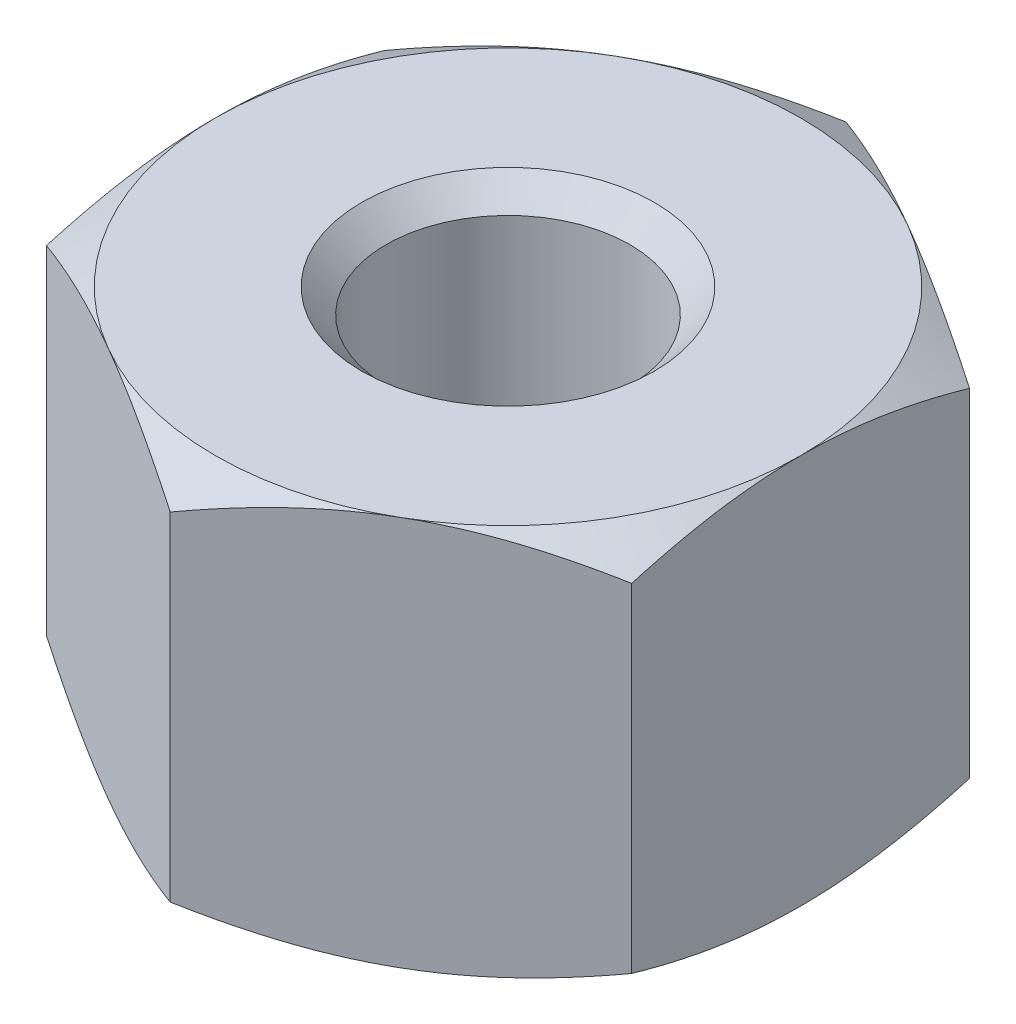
ISO-10303-21;
HEADER;
FILE_DESCRIPTION(('STEP AP214'),'2;1');
FILE_NAME('part.step','',(''),(''),'','','');
FILE_SCHEMA(('AUTOMOTIVE_DESIGN { 1 0 10303 214 1 1 1 1 }'));
ENDSEC;
DATA;
#1=APPLICATION_CONTEXT('core data for automotive mechanical design processes');
#2=APPLICATION_PROTOCOL_DEFINITION('international standard','automotive_design',2000,#1);
#3=PRODUCT_CONTEXT('',#1,'mechanical');
#4=PRODUCT('Part','Part','',(#3));
#5=PRODUCT_RELATED_PRODUCT_CATEGORY('part','',(#4));
#6=PRODUCT_DEFINITION_FORMATION('','',#4);
#7=PRODUCT_DEFINITION_CONTEXT('part definition',#1,'design');
#8=PRODUCT_DEFINITION('design','',#6,#7);
#9=PRODUCT_DEFINITION_SHAPE('','',#8);
#10=(LENGTH_UNIT() NAMED_UNIT(*) SI_UNIT(.MILLI.,.METRE.));
#11=(NAMED_UNIT(*) PLANE_ANGLE_UNIT() SI_UNIT($,.RADIAN.));
#12=(NAMED_UNIT(*) SI_UNIT($,.STERADIAN.) SOLID_ANGLE_UNIT());
#13=UNCERTAINTY_MEASURE_WITH_UNIT(LENGTH_MEASURE(1.E-05),#10,'distance_accuracy_value','');
#14=(GEOMETRIC_REPRESENTATION_CONTEXT(3) GLOBAL_UNCERTAINTY_ASSIGNED_CONTEXT((#13)) GLOBAL_UNIT_ASSIGNED_CONTEXT((#10,
#11,#12)) REPRESENTATION_CONTEXT('',''));
#15=CARTESIAN_POINT('',(0.,0.,0.));
#16=DIRECTION('',(0.,0.,1.));
#17=DIRECTION('',(1.,0.,0.));
#18=AXIS2_PLACEMENT_3D('',#15,#16,#17);
#19=CARTESIAN_POINT('',(0.,-2.,0.));
#20=DIRECTION('',(0.,1.,0.));
#21=DIRECTION('',(0.,0.,1.));
#22=AXIS2_PLACEMENT_3D('',#19,#20,#21);
#23=PLANE('',#22);
#24=CARTESIAN_POINT('',(0.,-2.,0.));
#25=DIRECTION('',(0.,1.,0.));
#26=DIRECTION('',(0.,0.,1.));
#27=AXIS2_PLACEMENT_3D('',#24,#25,#26);
#28=CIRCLE('',#27,1.5);
#29=CARTESIAN_POINT('',(0.,-2.,1.5));
#30=VERTEX_POINT('',#29);
#31=EDGE_CURVE('E12',#30,#30,#28,.T.);
#32=ORIENTED_EDGE('',*,*,#31,.T.);
#33=EDGE_LOOP('',(#32));
#34=FACE_BOUND('',#33,.T.);
#35=CARTESIAN_POINT('',(0.,-2.,0.));
#36=DIRECTION('',(0.,1.,0.));
#37=DIRECTION('',(0.,0.,1.));
#38=AXIS2_PLACEMENT_3D('',#35,#36,#37);
#39=CIRCLE('',#38,3.);
#40=CARTESIAN_POINT('',(1.5,-2.,2.59807621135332));
#41=VERTEX_POINT('',#40);
#42=CARTESIAN_POINT('',(-1.5,-2.,2.59807621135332));
#43=VERTEX_POINT('',#42);
#44=EDGE_CURVE('E140',#41,#43,#39,.F.);
#45=ORIENTED_EDGE('',*,*,#44,.T.);
#46=CARTESIAN_POINT('',(-3.,-2.,0.));
#47=VERTEX_POINT('',#46);
#48=EDGE_CURVE('E53',#43,#47,#39,.F.);
#49=ORIENTED_EDGE('',*,*,#48,.T.);
#50=CARTESIAN_POINT('',(-1.5,-2.,-2.59807621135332));
#51=VERTEX_POINT('',#50);
#52=EDGE_CURVE('E379',#47,#51,#39,.F.);
#53=ORIENTED_EDGE('',*,*,#52,.T.);
#54=CARTESIAN_POINT('',(1.5,-2.,-2.59807621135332));
#55=VERTEX_POINT('',#54);
#56=EDGE_CURVE('E381',#51,#55,#39,.F.);
#57=ORIENTED_EDGE('',*,*,#56,.T.);
#58=CARTESIAN_POINT('',(3.,-2.,0.));
#59=VERTEX_POINT('',#58);
#60=EDGE_CURVE('E145',#55,#59,#39,.F.);
#61=ORIENTED_EDGE('',*,*,#60,.T.);
#62=CARTESIAN_POINT('',(0.,-2.,0.));
#63=DIRECTION('',(0.,1.,0.));
#64=DIRECTION('',(0.,0.,1.));
#65=AXIS2_PLACEMENT_3D('',#62,#63,#64);
#66=CIRCLE('',#65,3.);
#67=EDGE_CURVE('E131',#41,#59,#66,.T.);
#68=ORIENTED_EDGE('',*,*,#67,.F.);
#69=EDGE_LOOP('',(#45,#49,#53,#57,#61,#68));
#70=FACE_BOUND('',#69,.T.);
#71=ADVANCED_FACE('F38',(#34,#70),#23,.F.);
#72=CARTESIAN_POINT('',(0.,2.,3.46410161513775));
#73=DIRECTION('',(-0.5,0.,-0.866025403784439));
#74=DIRECTION('',(-0.866025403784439,0.,0.5));
#75=AXIS2_PLACEMENT_3D('',#72,#73,#74);
#76=PLANE('',#75);
#77=DIRECTION('',(0.,-1.,0.));
#78=VECTOR('',#77,1.);
#79=CARTESIAN_POINT('',(0.,2.,3.46410161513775));
#80=LINE('',#79,#78);
#81=CARTESIAN_POINT('',(0.,1.73205080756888,3.46410161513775));
#82=VERTEX_POINT('',#81);
#83=CARTESIAN_POINT('',(0.,-1.73205080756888,3.46410161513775));
#84=VERTEX_POINT('',#83);
#85=EDGE_CURVE('E155',#82,#84,#80,.T.);
#86=ORIENTED_EDGE('',*,*,#85,.T.);
#87=CARTESIAN_POINT('',(-0.000200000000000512,-1.73198413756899,3.46421708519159));
#88=CARTESIAN_POINT('',(0.131635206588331,-1.77594629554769,3.38810199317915));
#89=CARTESIAN_POINT('',(0.264608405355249,-1.81592841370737,3.31132988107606));
#90=CARTESIAN_POINT('',(0.532857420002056,-1.88571791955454,3.15645624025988));
#91=CARTESIAN_POINT('',(0.668138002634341,-1.91550061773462,3.078351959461));
#92=CARTESIAN_POINT('',(0.937022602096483,-1.96186216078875,2.92311136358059));
#93=CARTESIAN_POINT('',(1.07058524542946,-1.97874955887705,2.84599893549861));
#94=CARTESIAN_POINT('',(1.33833905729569,-1.99891035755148,2.6914112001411));
#95=CARTESIAN_POINT('',(1.47252925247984,-2.00220045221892,2.61393645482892));
#96=CARTESIAN_POINT('',(1.72327559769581,-1.99535946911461,2.46916798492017));
#97=CARTESIAN_POINT('',(1.83986926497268,-1.98690808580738,2.40185259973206));
#98=CARTESIAN_POINT('',(2.07229698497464,-1.96012105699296,2.2676603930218));
#99=CARTESIAN_POINT('',(2.18813023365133,-1.94177625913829,2.2007840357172));
#100=CARTESIAN_POINT('',(2.42103725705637,-1.89591524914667,2.06631510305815));
#101=CARTESIAN_POINT('',(2.53808155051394,-1.86820461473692,1.99873954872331));
#102=CARTESIAN_POINT('',(2.77042435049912,-1.8053122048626,1.86459637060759));
#103=CARTESIAN_POINT('',(2.88572583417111,-1.77014520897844,1.79802702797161));
#104=CARTESIAN_POINT('',(3.0002,-1.73198413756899,1.73193533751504));
#105=B_SPLINE_CURVE_WITH_KNOTS('',3,(#87,#88,#89,#90,#91,#92,#93,#94,#95,#96,#97,#98,#99,#100,
#101,#102,#103,#104),.UNSPECIFIED.,.F.,.F.,(4,2,2,2,2,2,2,2,4),(0.,0.475539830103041,
0.952222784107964,1.41710776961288,1.88142182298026,2.28572436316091,2.69040156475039,
3.10405572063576,3.5168974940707),.UNSPECIFIED.);
#106=EDGE_CURVE('E60',#84,#41,#105,.T.);
#107=ORIENTED_EDGE('',*,*,#106,.T.);
#108=CARTESIAN_POINT('',(3.,-1.73205080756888,1.73205080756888));
#109=VERTEX_POINT('',#108);
#110=EDGE_CURVE('E128',#41,#109,#105,.T.);
#111=ORIENTED_EDGE('',*,*,#110,.T.);
#112=DIRECTION('',(0.,-1.,0.));
#113=VECTOR('',#112,1.);
#114=CARTESIAN_POINT('',(3.,2.,1.73205080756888));
#115=LINE('',#114,#113);
#116=CARTESIAN_POINT('',(3.,1.73205080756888,1.73205080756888));
#117=VERTEX_POINT('',#116);
#118=EDGE_CURVE('E272',#117,#109,#115,.T.);
#119=ORIENTED_EDGE('',*,*,#118,.F.);
#120=CARTESIAN_POINT('',(-0.000200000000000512,1.73198413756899,3.46421708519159));
#121=CARTESIAN_POINT('',(0.131635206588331,1.77594629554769,3.38810199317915));
#122=CARTESIAN_POINT('',(0.264608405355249,1.81592841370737,3.31132988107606));
#123=CARTESIAN_POINT('',(0.532857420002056,1.88571791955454,3.15645624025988));
#124=CARTESIAN_POINT('',(0.668138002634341,1.91550061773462,3.078351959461));
#125=CARTESIAN_POINT('',(0.937022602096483,1.96186216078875,2.92311136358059));
#126=CARTESIAN_POINT('',(1.07058524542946,1.97874955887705,2.84599893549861));
#127=CARTESIAN_POINT('',(1.33833905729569,1.99891035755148,2.6914112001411));
#128=CARTESIAN_POINT('',(1.47252925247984,2.00220045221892,2.61393645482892));
#129=CARTESIAN_POINT('',(1.72327559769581,1.99535946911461,2.46916798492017));
#130=CARTESIAN_POINT('',(1.83986926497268,1.98690808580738,2.40185259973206));
#131=CARTESIAN_POINT('',(2.07229698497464,1.96012105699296,2.2676603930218));
#132=CARTESIAN_POINT('',(2.18813023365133,1.94177625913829,2.2007840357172));
#133=CARTESIAN_POINT('',(2.42103725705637,1.89591524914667,2.06631510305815));
#134=CARTESIAN_POINT('',(2.53808155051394,1.86820461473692,1.99873954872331));
#135=CARTESIAN_POINT('',(2.77042435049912,1.8053122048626,1.86459637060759));
#136=CARTESIAN_POINT('',(2.88572583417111,1.77014520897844,1.79802702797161));
#137=CARTESIAN_POINT('',(3.0002,1.73198413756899,1.73193533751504));
#138=B_SPLINE_CURVE_WITH_KNOTS('',3,(#120,#121,#122,#123,#124,#125,#126,#127,#128,#129,#130,
#131,#132,#133,#134,#135,#136,#137),.UNSPECIFIED.,.F.,.F.,(4,2,2,2,2,2,2,2,4),(0.,
0.475539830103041,0.952222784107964,1.41710776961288,1.88142182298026,2.28572436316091,
2.69040156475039,3.10405572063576,3.5168974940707),.UNSPECIFIED.);
#139=CARTESIAN_POINT('',(1.5,2.,2.59807621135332));
#140=VERTEX_POINT('',#139);
#141=EDGE_CURVE('E252',#140,#117,#138,.T.);
#142=ORIENTED_EDGE('',*,*,#141,.F.);
#143=EDGE_CURVE('E258',#82,#140,#138,.T.);
#144=ORIENTED_EDGE('',*,*,#143,.F.);
#145=EDGE_LOOP('',(#86,#107,#111,#119,#142,#144));
#146=FACE_BOUND('',#145,.T.);
#147=ADVANCED_FACE('F152',(#146),#76,.F.);
#148=CARTESIAN_POINT('',(3.,2.,1.73205080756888));
#149=DIRECTION('',(-1.,0.,0.));
#150=DIRECTION('',(0.,0.,1.));
#151=AXIS2_PLACEMENT_3D('',#148,#149,#150);
#152=PLANE('',#151);
#153=ORIENTED_EDGE('',*,*,#118,.T.);
#154=CARTESIAN_POINT('',(3.,-0.501054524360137,-4.72419421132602));
#155=CARTESIAN_POINT('',(3.,-0.565208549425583,-4.59252982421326));
#156=CARTESIAN_POINT('',(3.,-0.628767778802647,-4.46057075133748));
#157=CARTESIAN_POINT('',(3.,-0.75436344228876,-4.19590675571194));
#158=CARTESIAN_POINT('',(3.,-0.816399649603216,-4.06320172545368));
#159=CARTESIAN_POINT('',(3.,-0.938912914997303,-3.79623955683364));
#160=CARTESIAN_POINT('',(3.,-0.999380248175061,-3.66197794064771));
#161=CARTESIAN_POINT('',(3.,-1.11793387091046,-3.39241144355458));
#162=CARTESIAN_POINT('',(3.,-1.17602026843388,-3.25710661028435));
#163=CARTESIAN_POINT('',(3.,-1.29110063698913,-2.98063811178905));
#164=CARTESIAN_POINT('',(3.,-1.34799110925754,-2.83943113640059));
#165=CARTESIAN_POINT('',(3.,-1.45763737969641,-2.55539190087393));
#166=CARTESIAN_POINT('',(3.,-1.51039272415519,-2.41255946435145));
#167=CARTESIAN_POINT('',(3.,-1.61043634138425,-2.12528687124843));
#168=CARTESIAN_POINT('',(3.,-1.65773508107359,-1.98085039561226));
#169=CARTESIAN_POINT('',(3.,-1.74539546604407,-1.68990675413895));
#170=CARTESIAN_POINT('',(3.,-1.78575922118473,-1.54340023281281));
#171=CARTESIAN_POINT('',(3.,-1.8574462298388,-1.2490437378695));
#172=CARTESIAN_POINT('',(3.,-1.88882005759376,-1.10120630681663));
#173=CARTESIAN_POINT('',(3.,-1.94080019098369,-0.803620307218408));
#174=CARTESIAN_POINT('',(3.,-1.96140766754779,-0.653871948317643));
#175=CARTESIAN_POINT('',(3.,-1.98994502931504,-0.355196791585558));
#176=CARTESIAN_POINT('',(3.,-1.99804348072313,-0.206286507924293));
#177=CARTESIAN_POINT('',(3.,-2.0013247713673,0.0916923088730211));
#178=CARTESIAN_POINT('',(3.,-1.9965074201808,0.240760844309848));
#179=CARTESIAN_POINT('',(3.,-1.97787199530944,0.491723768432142));
#180=CARTESIAN_POINT('',(3.,-1.96731758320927,0.593876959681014));
#181=CARTESIAN_POINT('',(3.,-1.94076249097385,0.797477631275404));
#182=CARTESIAN_POINT('',(3.,-1.92476113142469,0.898925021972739));
#183=CARTESIAN_POINT('',(3.,-1.86942337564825,1.20204703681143));
#184=CARTESIAN_POINT('',(3.,-1.82276174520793,1.40240158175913));
#185=CARTESIAN_POINT('',(3.,-1.74129864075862,1.70214891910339));
#186=CARTESIAN_POINT('',(3.,-1.71182816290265,1.80307937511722));
#187=CARTESIAN_POINT('',(3.,-1.64969066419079,2.00396102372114));
#188=CARTESIAN_POINT('',(3.,-1.61702361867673,2.10391220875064));
#189=CARTESIAN_POINT('',(3.,-1.54902842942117,2.30286555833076));
#190=CARTESIAN_POINT('',(3.,-1.51370103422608,2.40186798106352));
#191=CARTESIAN_POINT('',(3.,-1.44081429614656,2.59904247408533));
#192=CARTESIAN_POINT('',(3.,-1.40325500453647,2.69721456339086));
#193=CARTESIAN_POINT('',(3.,-1.29921162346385,2.96159002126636));
#194=CARTESIAN_POINT('',(3.,-1.23095748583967,3.12709614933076));
#195=CARTESIAN_POINT('',(3.,-1.09043300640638,3.45640087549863));
#196=CARTESIAN_POINT('',(3.,-1.01816221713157,3.62019928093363));
#197=CARTESIAN_POINT('',(3.,-0.870559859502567,3.94647574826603));
#198=CARTESIAN_POINT('',(3.,-0.795227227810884,4.10895332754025));
#199=CARTESIAN_POINT('',(3.,-0.642221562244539,4.43280485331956));
#200=CARTESIAN_POINT('',(3.,-0.564548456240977,4.59417876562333));
#201=CARTESIAN_POINT('',(3.,-0.328572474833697,5.07748126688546));
#202=CARTESIAN_POINT('',(3.,-0.167548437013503,5.39807947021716));
#203=CARTESIAN_POINT('',(3.,0.159040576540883,6.03685099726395));
#204=CARTESIAN_POINT('',(3.,0.324604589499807,6.35502481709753));
#205=CARTESIAN_POINT('',(3.,0.641121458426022,6.95610524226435));
#206=CARTESIAN_POINT('',(3.,0.791763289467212,7.23917590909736));
#207=CARTESIAN_POINT('',(3.,1.09485975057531,7.80436605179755));
#208=CARTESIAN_POINT('',(3.,1.24731449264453,8.08648546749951));
#209=CARTESIAN_POINT('',(3.,1.55305256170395,8.6490441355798));
#210=CARTESIAN_POINT('',(3.,1.70633136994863,8.92948584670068));
#211=CARTESIAN_POINT('',(3.,2.01391884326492,9.4897751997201));
#212=CARTESIAN_POINT('',(3.,2.16822742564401,9.76962288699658));
#213=CARTESIAN_POINT('',(3.,2.32291043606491,10.0492620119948));
#214=B_SPLINE_CURVE_WITH_KNOTS('',3,(#154,#155,#156,#157,#158,#159,#160,#161,#162,#163,#164,
#165,#166,#167,#168,#169,#170,#171,#172,#173,#174,#175,#176,#177,#178,#179,#180,#181,#182,#183,
#184,#185,#186,#187,#188,#189,#190,#191,#192,#193,#194,#195,#196,#197,#198,#199,#200,#201,#202,
#203,#204,#205,#206,#207,#208,#209,#210,#211,#212,#213),.UNSPECIFIED.,.F.,.F.,(4,2,2,2,2,2,2,2,
2,2,2,2,2,2,2,2,2,2,2,2,2,2,2,2,2,2,2,2,2,4),(0.,0.439392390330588,0.878849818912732,
1.32058042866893,1.76229098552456,2.21895022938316,2.67565950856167,3.13147762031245,
3.58715681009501,4.04021978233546,4.49323346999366,4.94008757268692,5.38694826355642,
5.69489123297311,6.00287262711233,6.61913487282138,6.934541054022,7.24994966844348,
7.56526986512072,7.88058282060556,8.41758645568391,8.95465003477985,9.49190174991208,
10.0291700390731,11.1053945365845,12.1813925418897,13.1433594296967,14.1053860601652,
15.0641732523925,16.0228843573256),.UNSPECIFIED.);
#215=EDGE_CURVE('E134',#109,#59,#214,.F.);
#216=ORIENTED_EDGE('',*,*,#215,.T.);
#217=CARTESIAN_POINT('',(3.,-1.73205080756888,-1.73205080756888));
#218=VERTEX_POINT('',#217);
#219=EDGE_CURVE('E167',#59,#218,#214,.F.);
#220=ORIENTED_EDGE('',*,*,#219,.T.);
#221=DIRECTION('',(0.,-1.,0.));
#222=VECTOR('',#221,1.);
#223=CARTESIAN_POINT('',(3.,2.,-1.73205080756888));
#224=LINE('',#223,#222);
#225=CARTESIAN_POINT('',(3.,1.73205080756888,-1.73205080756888));
#226=VERTEX_POINT('',#225);
#227=EDGE_CURVE('E269',#226,#218,#224,.T.);
#228=ORIENTED_EDGE('',*,*,#227,.F.);
#229=CARTESIAN_POINT('',(3.,0.501054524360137,-4.72419421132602));
#230=CARTESIAN_POINT('',(3.,0.565208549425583,-4.59252982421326));
#231=CARTESIAN_POINT('',(3.,0.628767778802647,-4.46057075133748));
#232=CARTESIAN_POINT('',(3.,0.75436344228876,-4.19590675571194));
#233=CARTESIAN_POINT('',(3.,0.816399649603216,-4.06320172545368));
#234=CARTESIAN_POINT('',(3.,0.938912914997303,-3.79623955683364));
#235=CARTESIAN_POINT('',(3.,0.999380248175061,-3.66197794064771));
#236=CARTESIAN_POINT('',(3.,1.11793387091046,-3.39241144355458));
#237=CARTESIAN_POINT('',(3.,1.17602026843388,-3.25710661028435));
#238=CARTESIAN_POINT('',(3.,1.29110063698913,-2.98063811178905));
#239=CARTESIAN_POINT('',(3.,1.34799110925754,-2.83943113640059));
#240=CARTESIAN_POINT('',(3.,1.45763737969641,-2.55539190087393));
#241=CARTESIAN_POINT('',(3.,1.51039272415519,-2.41255946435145));
#242=CARTESIAN_POINT('',(3.,1.61043634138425,-2.12528687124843));
#243=CARTESIAN_POINT('',(3.,1.65773508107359,-1.98085039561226));
#244=CARTESIAN_POINT('',(3.,1.74539546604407,-1.68990675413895));
#245=CARTESIAN_POINT('',(3.,1.78575922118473,-1.54340023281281));
#246=CARTESIAN_POINT('',(3.,1.8574462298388,-1.2490437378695));
#247=CARTESIAN_POINT('',(3.,1.88882005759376,-1.10120630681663));
#248=CARTESIAN_POINT('',(3.,1.94080019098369,-0.803620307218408));
#249=CARTESIAN_POINT('',(3.,1.96140766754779,-0.653871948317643));
#250=CARTESIAN_POINT('',(3.,1.98994502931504,-0.355196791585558));
#251=CARTESIAN_POINT('',(3.,1.99804348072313,-0.206286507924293));
#252=CARTESIAN_POINT('',(3.,2.0013247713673,0.0916923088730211));
#253=CARTESIAN_POINT('',(3.,1.9965074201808,0.240760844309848));
#254=CARTESIAN_POINT('',(3.,1.97787199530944,0.491723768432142));
#255=CARTESIAN_POINT('',(3.,1.96731758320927,0.593876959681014));
#256=CARTESIAN_POINT('',(3.,1.94076249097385,0.797477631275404));
#257=CARTESIAN_POINT('',(3.,1.92476113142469,0.898925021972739));
#258=CARTESIAN_POINT('',(3.,1.86942337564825,1.20204703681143));
#259=CARTESIAN_POINT('',(3.,1.82276174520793,1.40240158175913));
#260=CARTESIAN_POINT('',(3.,1.74129864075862,1.70214891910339));
#261=CARTESIAN_POINT('',(3.,1.71182816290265,1.80307937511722));
#262=CARTESIAN_POINT('',(3.,1.64969066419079,2.00396102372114));
#263=CARTESIAN_POINT('',(3.,1.61702361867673,2.10391220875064));
#264=CARTESIAN_POINT('',(3.,1.54902842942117,2.30286555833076));
#265=CARTESIAN_POINT('',(3.,1.51370103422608,2.40186798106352));
#266=CARTESIAN_POINT('',(3.,1.44081429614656,2.59904247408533));
#267=CARTESIAN_POINT('',(3.,1.40325500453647,2.69721456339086));
#268=CARTESIAN_POINT('',(3.,1.29921162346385,2.96159002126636));
#269=CARTESIAN_POINT('',(3.,1.23095748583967,3.12709614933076));
#270=CARTESIAN_POINT('',(3.,1.09043300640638,3.45640087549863));
#271=CARTESIAN_POINT('',(3.,1.01816221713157,3.62019928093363));
#272=CARTESIAN_POINT('',(3.,0.870559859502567,3.94647574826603));
#273=CARTESIAN_POINT('',(3.,0.795227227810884,4.10895332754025));
#274=CARTESIAN_POINT('',(3.,0.642221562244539,4.43280485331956));
#275=CARTESIAN_POINT('',(3.,0.564548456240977,4.59417876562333));
#276=CARTESIAN_POINT('',(3.,0.328572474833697,5.07748126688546));
#277=CARTESIAN_POINT('',(3.,0.167548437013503,5.39807947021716));
#278=CARTESIAN_POINT('',(3.,-0.159040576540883,6.03685099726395));
#279=CARTESIAN_POINT('',(3.,-0.324604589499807,6.35502481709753));
#280=CARTESIAN_POINT('',(3.,-0.641121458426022,6.95610524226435));
#281=CARTESIAN_POINT('',(3.,-0.791763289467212,7.23917590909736));
#282=CARTESIAN_POINT('',(3.,-1.09485975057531,7.80436605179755));
#283=CARTESIAN_POINT('',(3.,-1.24731449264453,8.08648546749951));
#284=CARTESIAN_POINT('',(3.,-1.55305256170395,8.6490441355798));
#285=CARTESIAN_POINT('',(3.,-1.70633136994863,8.92948584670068));
#286=CARTESIAN_POINT('',(3.,-2.01391884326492,9.4897751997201));
#287=CARTESIAN_POINT('',(3.,-2.16822742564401,9.76962288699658));
#288=CARTESIAN_POINT('',(3.,-2.32291043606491,10.0492620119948));
#289=B_SPLINE_CURVE_WITH_KNOTS('',3,(#229,#230,#231,#232,#233,#234,#235,#236,#237,#238,#239,
#240,#241,#242,#243,#244,#245,#246,#247,#248,#249,#250,#251,#252,#253,#254,#255,#256,#257,#258,
#259,#260,#261,#262,#263,#264,#265,#266,#267,#268,#269,#270,#271,#272,#273,#274,#275,#276,#277,
#278,#279,#280,#281,#282,#283,#284,#285,#286,#287,#288),.UNSPECIFIED.,.F.,.F.,(4,2,2,2,2,2,2,2,
2,2,2,2,2,2,2,2,2,2,2,2,2,2,2,2,2,2,2,2,2,4),(0.,0.439392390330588,0.878849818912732,
1.32058042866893,1.76229098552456,2.21895022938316,2.67565950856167,3.13147762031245,
3.58715681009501,4.04021978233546,4.49323346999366,4.94008757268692,5.38694826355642,
5.69489123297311,6.00287262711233,6.61913487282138,6.934541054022,7.24994966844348,
7.56526986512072,7.88058282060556,8.41758645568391,8.95465003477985,9.49190174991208,
10.0291700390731,11.1053945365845,12.1813925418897,13.1433594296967,14.1053860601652,
15.0641732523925,16.0228843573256),.UNSPECIFIED.);
#290=CARTESIAN_POINT('',(3.,2.,0.));
#291=VERTEX_POINT('',#290);
#292=EDGE_CURVE('E245',#291,#226,#289,.F.);
#293=ORIENTED_EDGE('',*,*,#292,.F.);
#294=EDGE_CURVE('E251',#117,#291,#289,.F.);
#295=ORIENTED_EDGE('',*,*,#294,.F.);
#296=EDGE_LOOP('',(#153,#216,#220,#228,#293,#295));
#297=FACE_BOUND('',#296,.T.);
#298=ADVANCED_FACE('F224',(#297),#152,.F.);
#299=CARTESIAN_POINT('',(3.,2.,-1.73205080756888));
#300=DIRECTION('',(-0.5,0.,0.866025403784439));
#301=DIRECTION('',(0.866025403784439,0.,0.5));
#302=AXIS2_PLACEMENT_3D('',#299,#300,#301);
#303=PLANE('',#302);
#304=ORIENTED_EDGE('',*,*,#227,.T.);
#305=CARTESIAN_POINT('',(3.0002,-1.73198413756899,-1.73193533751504));
#306=CARTESIAN_POINT('',(2.86836479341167,-1.77594629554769,-1.80805042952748));
#307=CARTESIAN_POINT('',(2.73539159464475,-1.81592841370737,-1.88482254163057));
#308=CARTESIAN_POINT('',(2.46714257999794,-1.88571791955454,-2.03969618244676));
#309=CARTESIAN_POINT('',(2.33186199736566,-1.91550061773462,-2.11780046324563));
#310=CARTESIAN_POINT('',(2.06297739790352,-1.96186216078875,-2.27304105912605));
#311=CARTESIAN_POINT('',(1.92941475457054,-1.97874955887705,-2.35015348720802));
#312=CARTESIAN_POINT('',(1.66166094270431,-1.99891035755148,-2.50474122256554));
#313=CARTESIAN_POINT('',(1.52747074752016,-2.00220045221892,-2.58221596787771));
#314=CARTESIAN_POINT('',(1.27672440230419,-1.99535946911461,-2.72698443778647));
#315=CARTESIAN_POINT('',(1.16013073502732,-1.98690808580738,-2.79429982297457));
#316=CARTESIAN_POINT('',(0.927703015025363,-1.96012105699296,-2.92849202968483));
#317=CARTESIAN_POINT('',(0.811869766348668,-1.94177625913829,-2.99536838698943));
#318=CARTESIAN_POINT('',(0.578962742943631,-1.89591524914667,-3.12983731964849));
#319=CARTESIAN_POINT('',(0.461918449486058,-1.86820461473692,-3.19741287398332));
#320=CARTESIAN_POINT('',(0.229575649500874,-1.8053122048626,-3.33155605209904));
#321=CARTESIAN_POINT('',(0.114274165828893,-1.77014520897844,-3.39812539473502));
#322=CARTESIAN_POINT('',(-0.000200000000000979,-1.73198413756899,-3.46421708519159));
#323=B_SPLINE_CURVE_WITH_KNOTS('',3,(#305,#306,#307,#308,#309,#310,#311,#312,#313,#314,#315,
#316,#317,#318,#319,#320,#321,#322),.UNSPECIFIED.,.F.,.F.,(4,2,2,2,2,2,2,2,4),(0.,
0.475539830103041,0.952222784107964,1.41710776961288,1.88142182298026,2.28572436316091,
2.69040156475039,3.10405572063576,3.5168974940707),.UNSPECIFIED.);
#324=EDGE_CURVE('E218',#218,#55,#323,.T.);
#325=ORIENTED_EDGE('',*,*,#324,.T.);
#326=CARTESIAN_POINT('',(0.,-1.73205080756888,-3.46410161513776));
#327=VERTEX_POINT('',#326);
#328=EDGE_CURVE('E211',#55,#327,#323,.T.);
#329=ORIENTED_EDGE('',*,*,#328,.T.);
#330=DIRECTION('',(0.,-1.,0.));
#331=VECTOR('',#330,1.);
#332=CARTESIAN_POINT('',(0.,2.,-3.46410161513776));
#333=LINE('',#332,#331);
#334=CARTESIAN_POINT('',(0.,1.73205080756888,-3.46410161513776));
#335=VERTEX_POINT('',#334);
#336=EDGE_CURVE('E266',#335,#327,#333,.T.);
#337=ORIENTED_EDGE('',*,*,#336,.F.);
#338=CARTESIAN_POINT('',(3.0002,1.73198413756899,-1.73193533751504));
#339=CARTESIAN_POINT('',(2.86836479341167,1.77594629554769,-1.80805042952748));
#340=CARTESIAN_POINT('',(2.73539159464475,1.81592841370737,-1.88482254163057));
#341=CARTESIAN_POINT('',(2.46714257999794,1.88571791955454,-2.03969618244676));
#342=CARTESIAN_POINT('',(2.33186199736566,1.91550061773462,-2.11780046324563));
#343=CARTESIAN_POINT('',(2.06297739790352,1.96186216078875,-2.27304105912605));
#344=CARTESIAN_POINT('',(1.92941475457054,1.97874955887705,-2.35015348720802));
#345=CARTESIAN_POINT('',(1.66166094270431,1.99891035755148,-2.50474122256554));
#346=CARTESIAN_POINT('',(1.52747074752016,2.00220045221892,-2.58221596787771));
#347=CARTESIAN_POINT('',(1.27672440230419,1.99535946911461,-2.72698443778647));
#348=CARTESIAN_POINT('',(1.16013073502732,1.98690808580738,-2.79429982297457));
#349=CARTESIAN_POINT('',(0.927703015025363,1.96012105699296,-2.92849202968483));
#350=CARTESIAN_POINT('',(0.811869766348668,1.94177625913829,-2.99536838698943));
#351=CARTESIAN_POINT('',(0.578962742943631,1.89591524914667,-3.12983731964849));
#352=CARTESIAN_POINT('',(0.461918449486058,1.86820461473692,-3.19741287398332));
#353=CARTESIAN_POINT('',(0.229575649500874,1.8053122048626,-3.33155605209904));
#354=CARTESIAN_POINT('',(0.114274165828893,1.77014520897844,-3.39812539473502));
#355=CARTESIAN_POINT('',(-0.000200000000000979,1.73198413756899,-3.46421708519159));
#356=B_SPLINE_CURVE_WITH_KNOTS('',3,(#338,#339,#340,#341,#342,#343,#344,#345,#346,#347,#348,
#349,#350,#351,#352,#353,#354,#355),.UNSPECIFIED.,.F.,.F.,(4,2,2,2,2,2,2,2,4),(0.,
0.475539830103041,0.952222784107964,1.41710776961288,1.88142182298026,2.28572436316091,
2.69040156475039,3.10405572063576,3.5168974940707),.UNSPECIFIED.);
#357=CARTESIAN_POINT('',(1.5,2.,-2.59807621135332));
#358=VERTEX_POINT('',#357);
#359=EDGE_CURVE('E230',#358,#335,#356,.T.);
#360=ORIENTED_EDGE('',*,*,#359,.F.);
#361=EDGE_CURVE('E237',#226,#358,#356,.T.);
#362=ORIENTED_EDGE('',*,*,#361,.F.);
#363=EDGE_LOOP('',(#304,#325,#329,#337,#360,#362));
#364=FACE_BOUND('',#363,.T.);
#365=ADVANCED_FACE('F220',(#364),#303,.F.);
#366=CARTESIAN_POINT('',(0.,2.,-3.46410161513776));
#367=DIRECTION('',(0.5,0.,0.866025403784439));
#368=DIRECTION('',(0.866025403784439,0.,-0.5));
#369=AXIS2_PLACEMENT_3D('',#366,#367,#368);
#370=PLANE('',#369);
#371=ORIENTED_EDGE('',*,*,#336,.T.);
#372=CARTESIAN_POINT('',(0.000199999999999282,-1.73198413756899,-3.46421708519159));
#373=CARTESIAN_POINT('',(-0.131635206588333,-1.77594629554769,-3.38810199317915));
#374=CARTESIAN_POINT('',(-0.26460840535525,-1.81592841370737,-3.31132988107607));
#375=CARTESIAN_POINT('',(-0.532857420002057,-1.88571791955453,-3.15645624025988));
#376=CARTESIAN_POINT('',(-0.668138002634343,-1.91550061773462,-3.078351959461));
#377=CARTESIAN_POINT('',(-0.937022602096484,-1.96186216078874,-2.92311136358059));
#378=CARTESIAN_POINT('',(-1.07058524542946,-1.97874955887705,-2.84599893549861));
#379=CARTESIAN_POINT('',(-1.33833905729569,-1.99891035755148,-2.6914112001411));
#380=CARTESIAN_POINT('',(-1.47252925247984,-2.00220045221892,-2.61393645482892));
#381=CARTESIAN_POINT('',(-1.72327559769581,-1.99535946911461,-2.46916798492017));
#382=CARTESIAN_POINT('',(-1.83986926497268,-1.98690808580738,-2.40185259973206));
#383=CARTESIAN_POINT('',(-2.07229698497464,-1.96012105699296,-2.2676603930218));
#384=CARTESIAN_POINT('',(-2.18813023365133,-1.94177625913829,-2.2007840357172));
#385=CARTESIAN_POINT('',(-2.42103725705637,-1.89591524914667,-2.06631510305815));
#386=CARTESIAN_POINT('',(-2.53808155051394,-1.86820461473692,-1.99873954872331));
#387=CARTESIAN_POINT('',(-2.77042435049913,-1.8053122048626,-1.86459637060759));
#388=CARTESIAN_POINT('',(-2.88572583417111,-1.77014520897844,-1.79802702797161));
#389=CARTESIAN_POINT('',(-3.0002,-1.73198413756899,-1.73193533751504));
#390=B_SPLINE_CURVE_WITH_KNOTS('',3,(#372,#373,#374,#375,#376,#377,#378,#379,#380,#381,#382,
#383,#384,#385,#386,#387,#388,#389),.UNSPECIFIED.,.F.,.F.,(4,2,2,2,2,2,2,2,4),(0.,
0.475539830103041,0.952222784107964,1.41710776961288,1.88142182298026,2.28572436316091,
2.69040156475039,3.10405572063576,3.5168974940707),.UNSPECIFIED.);
#391=EDGE_CURVE('E219',#327,#51,#390,.T.);
#392=ORIENTED_EDGE('',*,*,#391,.T.);
#393=CARTESIAN_POINT('',(-3.,-1.73205080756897,-1.73205080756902));
#394=VERTEX_POINT('',#393);
#395=EDGE_CURVE('E205',#51,#394,#390,.T.);
#396=ORIENTED_EDGE('',*,*,#395,.T.);
#397=DIRECTION('',(0.,-1.,0.));
#398=VECTOR('',#397,1.);
#399=CARTESIAN_POINT('',(-3.,2.,-1.73205080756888));
#400=LINE('',#399,#398);
#401=CARTESIAN_POINT('',(-3.,1.73205080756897,-1.73205080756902));
#402=VERTEX_POINT('',#401);
#403=EDGE_CURVE('E263',#402,#394,#400,.T.);
#404=ORIENTED_EDGE('',*,*,#403,.F.);
#405=CARTESIAN_POINT('',(0.000199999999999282,1.73198413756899,-3.46421708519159));
#406=CARTESIAN_POINT('',(-0.131635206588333,1.77594629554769,-3.38810199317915));
#407=CARTESIAN_POINT('',(-0.26460840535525,1.81592841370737,-3.31132988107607));
#408=CARTESIAN_POINT('',(-0.532857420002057,1.88571791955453,-3.15645624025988));
#409=CARTESIAN_POINT('',(-0.668138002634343,1.91550061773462,-3.078351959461));
#410=CARTESIAN_POINT('',(-0.937022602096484,1.96186216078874,-2.92311136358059));
#411=CARTESIAN_POINT('',(-1.07058524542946,1.97874955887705,-2.84599893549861));
#412=CARTESIAN_POINT('',(-1.33833905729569,1.99891035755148,-2.6914112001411));
#413=CARTESIAN_POINT('',(-1.47252925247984,2.00220045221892,-2.61393645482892));
#414=CARTESIAN_POINT('',(-1.72327559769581,1.99535946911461,-2.46916798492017));
#415=CARTESIAN_POINT('',(-1.83986926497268,1.98690808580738,-2.40185259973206));
#416=CARTESIAN_POINT('',(-2.07229698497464,1.96012105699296,-2.2676603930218));
#417=CARTESIAN_POINT('',(-2.18813023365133,1.94177625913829,-2.2007840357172));
#418=CARTESIAN_POINT('',(-2.42103725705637,1.89591524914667,-2.06631510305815));
#419=CARTESIAN_POINT('',(-2.53808155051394,1.86820461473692,-1.99873954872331));
#420=CARTESIAN_POINT('',(-2.77042435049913,1.8053122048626,-1.86459637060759));
#421=CARTESIAN_POINT('',(-2.88572583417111,1.77014520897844,-1.79802702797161));
#422=CARTESIAN_POINT('',(-3.0002,1.73198413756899,-1.73193533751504));
#423=B_SPLINE_CURVE_WITH_KNOTS('',3,(#405,#406,#407,#408,#409,#410,#411,#412,#413,#414,#415,
#416,#417,#418,#419,#420,#421,#422),.UNSPECIFIED.,.F.,.F.,(4,2,2,2,2,2,2,2,4),(0.,
0.475539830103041,0.952222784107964,1.41710776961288,1.88142182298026,2.28572436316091,
2.69040156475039,3.10405572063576,3.5168974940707),.UNSPECIFIED.);
#424=CARTESIAN_POINT('',(-1.5,2.,-2.59807621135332));
#425=VERTEX_POINT('',#424);
#426=EDGE_CURVE('E239',#425,#402,#423,.T.);
#427=ORIENTED_EDGE('',*,*,#426,.F.);
#428=EDGE_CURVE('E238',#335,#425,#423,.T.);
#429=ORIENTED_EDGE('',*,*,#428,.F.);
#430=EDGE_LOOP('',(#371,#392,#396,#404,#427,#429));
#431=FACE_BOUND('',#430,.T.);
#432=ADVANCED_FACE('F223',(#431),#370,.F.);
#433=CARTESIAN_POINT('',(-3.,2.,-1.73205080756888));
#434=DIRECTION('',(1.,0.,0.));
#435=DIRECTION('',(0.,0.,-1.));
#436=AXIS2_PLACEMENT_3D('',#433,#434,#435);
#437=PLANE('',#436);
#438=ORIENTED_EDGE('',*,*,#403,.T.);
#439=CARTESIAN_POINT('',(-3.,-0.50105452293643,-4.72419421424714));
#440=CARTESIAN_POINT('',(-3.,-0.565208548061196,-4.59252982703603));
#441=CARTESIAN_POINT('',(-3.,-0.628767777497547,-4.46057075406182));
#442=CARTESIAN_POINT('',(-3.,-0.754363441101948,-4.19590675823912));
#443=CARTESIAN_POINT('',(-3.,-0.816399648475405,-4.06320172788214));
#444=CARTESIAN_POINT('',(-3.,-0.938912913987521,-3.79623955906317));
#445=CARTESIAN_POINT('',(-3.,-0.999380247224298,-3.66197794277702));
#446=CARTESIAN_POINT('',(-3.,-1.11793387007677,-3.39241144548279));
#447=CARTESIAN_POINT('',(-3.,-1.17602026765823,-3.25710661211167));
#448=CARTESIAN_POINT('',(-3.,-1.29110063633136,-2.9806381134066));
#449=CARTESIAN_POINT('',(-3.,-1.34799110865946,-2.83943113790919));
#450=CARTESIAN_POINT('',(-3.,-1.45763737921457,-2.55539190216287));
#451=CARTESIAN_POINT('',(-3.,-1.51039272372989,-2.4125594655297));
#452=CARTESIAN_POINT('',(-3.,-1.61043634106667,-2.12528687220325));
#453=CARTESIAN_POINT('',(-3.,-1.65773508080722,-1.98085039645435));
#454=CARTESIAN_POINT('',(-3.,-1.74539546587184,-1.68990675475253));
#455=CARTESIAN_POINT('',(-3.,-1.78575922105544,-1.54340023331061));
#456=CARTESIAN_POINT('',(-3.,-1.85744622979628,-1.2490437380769));
#457=CARTESIAN_POINT('',(-3.,-1.8888200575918,-1.10120630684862));
#458=CARTESIAN_POINT('',(-3.,-1.9408001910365,-0.803620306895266));
#459=CARTESIAN_POINT('',(-3.,-1.96140766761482,-0.653871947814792));
#460=CARTESIAN_POINT('',(-3.,-1.98994502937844,-0.355196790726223));
#461=CARTESIAN_POINT('',(-3.,-1.99804348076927,-0.206286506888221));
#462=CARTESIAN_POINT('',(-3.,-2.00132477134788,0.0916923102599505));
#463=CARTESIAN_POINT('',(-3.,-1.99650742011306,0.240760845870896));
#464=CARTESIAN_POINT('',(-3.,-1.97787199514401,0.491723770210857));
#465=CARTESIAN_POINT('',(-3.,-1.96731758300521,0.593876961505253));
#466=CARTESIAN_POINT('',(-3.,-1.94076249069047,0.797477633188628));
#467=CARTESIAN_POINT('',(-3.,-1.92476113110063,0.898925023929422));
#468=CARTESIAN_POINT('',(-3.,-1.86942337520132,1.20204703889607));
#469=CARTESIAN_POINT('',(-3.,-1.82276174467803,1.40240158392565));
#470=CARTESIAN_POINT('',(-3.,-1.74129864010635,1.70214892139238));
#471=CARTESIAN_POINT('',(-3.,-1.71182816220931,1.80307937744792));
#472=CARTESIAN_POINT('',(-3.,-1.6496906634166,2.00396102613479));
#473=CARTESIAN_POINT('',(-3.,-1.61702361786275,2.10391221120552));
#474=CARTESIAN_POINT('',(-3.,-1.54902842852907,2.3028655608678));
#475=CARTESIAN_POINT('',(-3.,-1.51370103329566,2.40186798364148));
#476=CARTESIAN_POINT('',(-3.,-1.44081429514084,2.59904247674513));
#477=CARTESIAN_POINT('',(-3.,-1.40325500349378,2.69721456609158));
#478=CARTESIAN_POINT('',(-3.,-1.29921162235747,2.96159002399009));
#479=CARTESIAN_POINT('',(-3.,-1.23095748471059,3.12709615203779));
#480=CARTESIAN_POINT('',(-3.,-1.0904330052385,3.45640087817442));
#481=CARTESIAN_POINT('',(-3.,-1.01816221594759,3.62019928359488));
#482=CARTESIAN_POINT('',(-3.,-0.870559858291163,3.94647575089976));
#483=CARTESIAN_POINT('',(-3.,-0.795227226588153,4.10895333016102));
#484=CARTESIAN_POINT('',(-3.,-0.642221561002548,4.43280485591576));
#485=CARTESIAN_POINT('',(-3.,-0.564548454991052,4.59417876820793));
#486=CARTESIAN_POINT('',(-3.,-0.328572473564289,5.07748126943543));
#487=CARTESIAN_POINT('',(-3.,-0.167548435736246,5.39807947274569));
#488=CARTESIAN_POINT('',(-3.,0.159040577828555,6.03685099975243));
#489=CARTESIAN_POINT('',(-3.,0.32460459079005,6.3550248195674));
#490=CARTESIAN_POINT('',(-3.,0.641121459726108,6.95610524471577));
#491=CARTESIAN_POINT('',(-3.,0.791763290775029,7.23917591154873));
#492=CARTESIAN_POINT('',(-3.,1.09485975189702,7.80436605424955));
#493=CARTESIAN_POINT('',(-3.,1.2473144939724,8.08648546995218));
#494=CARTESIAN_POINT('',(-3.,1.55305256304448,8.64904413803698));
#495=CARTESIAN_POINT('',(-3.,1.70633137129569,8.9294858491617));
#496=CARTESIAN_POINT('',(-3.,2.01391884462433,9.48977520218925));
#497=CARTESIAN_POINT('',(-3.,2.16822742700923,9.76962288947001));
#498=CARTESIAN_POINT('',(-3.,2.32291043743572,10.0492620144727));
#499=B_SPLINE_CURVE_WITH_KNOTS('',3,(#439,#440,#441,#442,#443,#444,#445,#446,#447,#448,#449,
#450,#451,#452,#453,#454,#455,#456,#457,#458,#459,#460,#461,#462,#463,#464,#465,#466,#467,#468,
#469,#470,#471,#472,#473,#474,#475,#476,#477,#478,#479,#480,#481,#482,#483,#484,#485,#486,#487,
#488,#489,#490,#491,#492,#493,#494,#495,#496,#497,#498),.UNSPECIFIED.,.F.,.F.,(4,2,2,2,2,2,2,2,
2,2,2,2,2,2,2,2,2,2,2,2,2,2,2,2,2,2,2,2,2,4),(0.,0.439392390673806,0.878849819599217,
1.32058042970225,1.76229098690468,2.21895023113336,2.67565951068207,3.13147762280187,
3.58715681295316,4.04021978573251,4.49323347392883,4.94008757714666,5.38694826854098,
5.6948912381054,6.00287263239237,6.61913487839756,6.93454105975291,7.24994967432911,
7.56526987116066,7.88058282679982,8.41758646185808,8.95465004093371,9.49190175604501,
10.029170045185,11.1053945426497,12.1813925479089,13.1433594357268,14.1053860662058,
15.0641732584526,16.0228843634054),.UNSPECIFIED.);
#500=EDGE_CURVE('E375',#394,#47,#499,.T.);
#501=ORIENTED_EDGE('',*,*,#500,.T.);
#502=CARTESIAN_POINT('',(-3.,-1.73205080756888,1.73205080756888));
#503=VERTEX_POINT('',#502);
#504=EDGE_CURVE('E198',#47,#503,#499,.T.);
#505=ORIENTED_EDGE('',*,*,#504,.T.);
#506=DIRECTION('',(0.,-1.,0.));
#507=VECTOR('',#506,1.);
#508=CARTESIAN_POINT('',(-3.,2.,1.73205080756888));
#509=LINE('',#508,#507);
#510=CARTESIAN_POINT('',(-3.,1.73205080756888,1.73205080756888));
#511=VERTEX_POINT('',#510);
#512=EDGE_CURVE('E260',#511,#503,#509,.T.);
#513=ORIENTED_EDGE('',*,*,#512,.F.);
#514=CARTESIAN_POINT('',(-3.,0.50105452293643,-4.72419421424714));
#515=CARTESIAN_POINT('',(-3.,0.565208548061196,-4.59252982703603));
#516=CARTESIAN_POINT('',(-3.,0.628767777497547,-4.46057075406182));
#517=CARTESIAN_POINT('',(-3.,0.754363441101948,-4.19590675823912));
#518=CARTESIAN_POINT('',(-3.,0.816399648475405,-4.06320172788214));
#519=CARTESIAN_POINT('',(-3.,0.938912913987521,-3.79623955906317));
#520=CARTESIAN_POINT('',(-3.,0.999380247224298,-3.66197794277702));
#521=CARTESIAN_POINT('',(-3.,1.11793387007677,-3.39241144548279));
#522=CARTESIAN_POINT('',(-3.,1.17602026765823,-3.25710661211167));
#523=CARTESIAN_POINT('',(-3.,1.29110063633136,-2.9806381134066));
#524=CARTESIAN_POINT('',(-3.,1.34799110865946,-2.83943113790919));
#525=CARTESIAN_POINT('',(-3.,1.45763737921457,-2.55539190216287));
#526=CARTESIAN_POINT('',(-3.,1.51039272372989,-2.4125594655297));
#527=CARTESIAN_POINT('',(-3.,1.61043634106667,-2.12528687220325));
#528=CARTESIAN_POINT('',(-3.,1.65773508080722,-1.98085039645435));
#529=CARTESIAN_POINT('',(-3.,1.74539546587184,-1.68990675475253));
#530=CARTESIAN_POINT('',(-3.,1.78575922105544,-1.54340023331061));
#531=CARTESIAN_POINT('',(-3.,1.85744622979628,-1.2490437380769));
#532=CARTESIAN_POINT('',(-3.,1.8888200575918,-1.10120630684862));
#533=CARTESIAN_POINT('',(-3.,1.9408001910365,-0.803620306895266));
#534=CARTESIAN_POINT('',(-3.,1.96140766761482,-0.653871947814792));
#535=CARTESIAN_POINT('',(-3.,1.98994502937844,-0.355196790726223));
#536=CARTESIAN_POINT('',(-3.,1.99804348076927,-0.206286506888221));
#537=CARTESIAN_POINT('',(-3.,2.00132477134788,0.0916923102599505));
#538=CARTESIAN_POINT('',(-3.,1.99650742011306,0.240760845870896));
#539=CARTESIAN_POINT('',(-3.,1.97787199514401,0.491723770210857));
#540=CARTESIAN_POINT('',(-3.,1.96731758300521,0.593876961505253));
#541=CARTESIAN_POINT('',(-3.,1.94076249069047,0.797477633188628));
#542=CARTESIAN_POINT('',(-3.,1.92476113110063,0.898925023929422));
#543=CARTESIAN_POINT('',(-3.,1.86942337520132,1.20204703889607));
#544=CARTESIAN_POINT('',(-3.,1.82276174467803,1.40240158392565));
#545=CARTESIAN_POINT('',(-3.,1.74129864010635,1.70214892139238));
#546=CARTESIAN_POINT('',(-3.,1.71182816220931,1.80307937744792));
#547=CARTESIAN_POINT('',(-3.,1.6496906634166,2.00396102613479));
#548=CARTESIAN_POINT('',(-3.,1.61702361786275,2.10391221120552));
#549=CARTESIAN_POINT('',(-3.,1.54902842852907,2.3028655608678));
#550=CARTESIAN_POINT('',(-3.,1.51370103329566,2.40186798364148));
#551=CARTESIAN_POINT('',(-3.,1.44081429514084,2.59904247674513));
#552=CARTESIAN_POINT('',(-3.,1.40325500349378,2.69721456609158));
#553=CARTESIAN_POINT('',(-3.,1.29921162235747,2.96159002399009));
#554=CARTESIAN_POINT('',(-3.,1.23095748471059,3.12709615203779));
#555=CARTESIAN_POINT('',(-3.,1.0904330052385,3.45640087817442));
#556=CARTESIAN_POINT('',(-3.,1.01816221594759,3.62019928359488));
#557=CARTESIAN_POINT('',(-3.,0.870559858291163,3.94647575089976));
#558=CARTESIAN_POINT('',(-3.,0.795227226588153,4.10895333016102));
#559=CARTESIAN_POINT('',(-3.,0.642221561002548,4.43280485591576));
#560=CARTESIAN_POINT('',(-3.,0.564548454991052,4.59417876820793));
#561=CARTESIAN_POINT('',(-3.,0.328572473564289,5.07748126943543));
#562=CARTESIAN_POINT('',(-3.,0.167548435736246,5.39807947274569));
#563=CARTESIAN_POINT('',(-3.,-0.159040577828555,6.03685099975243));
#564=CARTESIAN_POINT('',(-3.,-0.32460459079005,6.3550248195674));
#565=CARTESIAN_POINT('',(-3.,-0.641121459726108,6.95610524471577));
#566=CARTESIAN_POINT('',(-3.,-0.791763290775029,7.23917591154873));
#567=CARTESIAN_POINT('',(-3.,-1.09485975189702,7.80436605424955));
#568=CARTESIAN_POINT('',(-3.,-1.2473144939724,8.08648546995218));
#569=CARTESIAN_POINT('',(-3.,-1.55305256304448,8.64904413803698));
#570=CARTESIAN_POINT('',(-3.,-1.70633137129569,8.9294858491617));
#571=CARTESIAN_POINT('',(-3.,-2.01391884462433,9.48977520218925));
#572=CARTESIAN_POINT('',(-3.,-2.16822742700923,9.76962288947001));
#573=CARTESIAN_POINT('',(-3.,-2.32291043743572,10.0492620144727));
#574=B_SPLINE_CURVE_WITH_KNOTS('',3,(#514,#515,#516,#517,#518,#519,#520,#521,#522,#523,#524,
#525,#526,#527,#528,#529,#530,#531,#532,#533,#534,#535,#536,#537,#538,#539,#540,#541,#542,#543,
#544,#545,#546,#547,#548,#549,#550,#551,#552,#553,#554,#555,#556,#557,#558,#559,#560,#561,#562,
#563,#564,#565,#566,#567,#568,#569,#570,#571,#572,#573),.UNSPECIFIED.,.F.,.F.,(4,2,2,2,2,2,2,2,
2,2,2,2,2,2,2,2,2,2,2,2,2,2,2,2,2,2,2,2,2,4),(0.,0.439392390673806,0.878849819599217,
1.32058042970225,1.76229098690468,2.21895023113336,2.67565951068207,3.13147762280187,
3.58715681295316,4.04021978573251,4.49323347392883,4.94008757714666,5.38694826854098,
5.6948912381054,6.00287263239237,6.61913487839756,6.93454105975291,7.24994967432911,
7.56526987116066,7.88058282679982,8.41758646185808,8.95465004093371,9.49190175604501,
10.029170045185,11.1053945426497,12.1813925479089,13.1433594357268,14.1053860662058,
15.0641732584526,16.0228843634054),.UNSPECIFIED.);
#575=CARTESIAN_POINT('',(-3.,2.,0.));
#576=VERTEX_POINT('',#575);
#577=EDGE_CURVE('E320',#576,#511,#574,.T.);
#578=ORIENTED_EDGE('',*,*,#577,.F.);
#579=EDGE_CURVE('E325',#402,#576,#574,.T.);
#580=ORIENTED_EDGE('',*,*,#579,.F.);
#581=EDGE_LOOP('',(#438,#501,#505,#513,#578,#580));
#582=FACE_BOUND('',#581,.T.);
#583=ADVANCED_FACE('F311',(#582),#437,.F.);
#584=CARTESIAN_POINT('',(-3.,2.,1.73205080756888));
#585=DIRECTION('',(0.5,0.,-0.866025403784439));
#586=DIRECTION('',(-0.866025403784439,0.,-0.5));
#587=AXIS2_PLACEMENT_3D('',#584,#585,#586);
#588=PLANE('',#587);
#589=ORIENTED_EDGE('',*,*,#512,.T.);
#590=CARTESIAN_POINT('',(-3.0002,-1.73198413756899,1.73193533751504));
#591=CARTESIAN_POINT('',(-2.86836479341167,-1.77594629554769,1.80805042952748));
#592=CARTESIAN_POINT('',(-2.73539159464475,-1.81592841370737,1.88482254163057));
#593=CARTESIAN_POINT('',(-2.46714257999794,-1.88571791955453,2.03969618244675));
#594=CARTESIAN_POINT('',(-2.33186199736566,-1.91550061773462,2.11780046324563));
#595=CARTESIAN_POINT('',(-2.06297739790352,-1.96186216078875,2.27304105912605));
#596=CARTESIAN_POINT('',(-1.92941475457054,-1.97874955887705,2.35015348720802));
#597=CARTESIAN_POINT('',(-1.66166094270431,-1.99891035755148,2.50474122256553));
#598=CARTESIAN_POINT('',(-1.52747074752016,-2.00220045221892,2.58221596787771));
#599=CARTESIAN_POINT('',(-1.27672440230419,-1.99535946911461,2.72698443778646));
#600=CARTESIAN_POINT('',(-1.16013073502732,-1.98690808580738,2.79429982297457));
#601=CARTESIAN_POINT('',(-0.927703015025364,-1.96012105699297,2.92849202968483));
#602=CARTESIAN_POINT('',(-0.811869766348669,-1.94177625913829,2.99536838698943));
#603=CARTESIAN_POINT('',(-0.578962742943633,-1.89591524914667,3.12983731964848));
#604=CARTESIAN_POINT('',(-0.46191844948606,-1.86820461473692,3.19741287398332));
#605=CARTESIAN_POINT('',(-0.229575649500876,-1.8053122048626,3.33155605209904));
#606=CARTESIAN_POINT('',(-0.114274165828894,-1.77014520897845,3.39812539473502));
#607=CARTESIAN_POINT('',(0.00019999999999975,-1.73198413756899,3.46421708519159));
#608=B_SPLINE_CURVE_WITH_KNOTS('',3,(#590,#591,#592,#593,#594,#595,#596,#597,#598,#599,#600,
#601,#602,#603,#604,#605,#606,#607),.UNSPECIFIED.,.F.,.F.,(4,2,2,2,2,2,2,2,4),(0.,
0.475539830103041,0.952222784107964,1.41710776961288,1.88142182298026,2.28572436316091,
2.69040156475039,3.10405572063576,3.5168974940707),.UNSPECIFIED.);
#609=EDGE_CURVE('E377',#503,#43,#608,.T.);
#610=ORIENTED_EDGE('',*,*,#609,.T.);
#611=EDGE_CURVE('E142',#43,#84,#608,.T.);
#612=ORIENTED_EDGE('',*,*,#611,.T.);
#613=ORIENTED_EDGE('',*,*,#85,.F.);
#614=CARTESIAN_POINT('',(-3.0002,1.73198413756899,1.73193533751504));
#615=CARTESIAN_POINT('',(-2.86836479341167,1.77594629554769,1.80805042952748));
#616=CARTESIAN_POINT('',(-2.73539159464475,1.81592841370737,1.88482254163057));
#617=CARTESIAN_POINT('',(-2.46714257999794,1.88571791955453,2.03969618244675));
#618=CARTESIAN_POINT('',(-2.33186199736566,1.91550061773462,2.11780046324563));
#619=CARTESIAN_POINT('',(-2.06297739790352,1.96186216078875,2.27304105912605));
#620=CARTESIAN_POINT('',(-1.92941475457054,1.97874955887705,2.35015348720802));
#621=CARTESIAN_POINT('',(-1.66166094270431,1.99891035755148,2.50474122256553));
#622=CARTESIAN_POINT('',(-1.52747074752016,2.00220045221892,2.58221596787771));
#623=CARTESIAN_POINT('',(-1.27672440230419,1.99535946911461,2.72698443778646));
#624=CARTESIAN_POINT('',(-1.16013073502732,1.98690808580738,2.79429982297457));
#625=CARTESIAN_POINT('',(-0.927703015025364,1.96012105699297,2.92849202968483));
#626=CARTESIAN_POINT('',(-0.811869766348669,1.94177625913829,2.99536838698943));
#627=CARTESIAN_POINT('',(-0.578962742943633,1.89591524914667,3.12983731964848));
#628=CARTESIAN_POINT('',(-0.46191844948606,1.86820461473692,3.19741287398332));
#629=CARTESIAN_POINT('',(-0.229575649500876,1.8053122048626,3.33155605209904));
#630=CARTESIAN_POINT('',(-0.114274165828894,1.77014520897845,3.39812539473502));
#631=CARTESIAN_POINT('',(0.00019999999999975,1.73198413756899,3.46421708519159));
#632=B_SPLINE_CURVE_WITH_KNOTS('',3,(#614,#615,#616,#617,#618,#619,#620,#621,#622,#623,#624,
#625,#626,#627,#628,#629,#630,#631),.UNSPECIFIED.,.F.,.F.,(4,2,2,2,2,2,2,2,4),(0.,
0.475539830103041,0.952222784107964,1.41710776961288,1.88142182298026,2.28572436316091,
2.69040156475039,3.10405572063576,3.5168974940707),.UNSPECIFIED.);
#633=CARTESIAN_POINT('',(-1.5,2.,2.59807621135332));
#634=VERTEX_POINT('',#633);
#635=EDGE_CURVE('E158',#634,#82,#632,.T.);
#636=ORIENTED_EDGE('',*,*,#635,.F.);
#637=EDGE_CURVE('E319',#511,#634,#632,.T.);
#638=ORIENTED_EDGE('',*,*,#637,.F.);
#639=EDGE_LOOP('',(#589,#610,#612,#613,#636,#638));
#640=FACE_BOUND('',#639,.T.);
#641=ADVANCED_FACE('F308',(#640),#588,.F.);
#642=CARTESIAN_POINT('',(0.,2.,0.));
#643=DIRECTION('',(0.,-1.,0.));
#644=DIRECTION('',(0.,0.,1.));
#645=AXIS2_PLACEMENT_3D('',#642,#643,#644);
#646=CONICAL_SURFACE('',#645,3.,1.0471975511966);
#647=ORIENTED_EDGE('',*,*,#143,.T.);
#648=CARTESIAN_POINT('',(0.,2.,0.));
#649=DIRECTION('',(0.,1.,0.));
#650=DIRECTION('',(0.,0.,1.));
#651=AXIS2_PLACEMENT_3D('',#648,#649,#650);
#652=CIRCLE('',#651,3.);
#653=EDGE_CURVE('E274',#634,#140,#652,.T.);
#654=ORIENTED_EDGE('',*,*,#653,.F.);
#655=ORIENTED_EDGE('',*,*,#635,.T.);
#656=EDGE_LOOP('',(#647,#654,#655));
#657=FACE_BOUND('',#656,.T.);
#658=ADVANCED_FACE('F183',(#657),#646,.T.);
#659=ORIENTED_EDGE('',*,*,#577,.T.);
#660=ORIENTED_EDGE('',*,*,#637,.T.);
#661=EDGE_CURVE('E276',#576,#634,#652,.T.);
#662=ORIENTED_EDGE('',*,*,#661,.F.);
#663=EDGE_LOOP('',(#659,#660,#662));
#664=FACE_BOUND('',#663,.T.);
#665=ADVANCED_FACE('F332',(#664),#646,.T.);
#666=ORIENTED_EDGE('',*,*,#426,.T.);
#667=ORIENTED_EDGE('',*,*,#579,.T.);
#668=EDGE_CURVE('E368',#425,#576,#652,.T.);
#669=ORIENTED_EDGE('',*,*,#668,.F.);
#670=EDGE_LOOP('',(#666,#667,#669));
#671=FACE_BOUND('',#670,.T.);
#672=ADVANCED_FACE('F367',(#671),#646,.T.);
#673=ORIENTED_EDGE('',*,*,#359,.T.);
#674=ORIENTED_EDGE('',*,*,#428,.T.);
#675=EDGE_CURVE('E360',#358,#425,#652,.T.);
#676=ORIENTED_EDGE('',*,*,#675,.F.);
#677=EDGE_LOOP('',(#673,#674,#676));
#678=FACE_BOUND('',#677,.T.);
#679=ADVANCED_FACE('F357',(#678),#646,.T.);
#680=ORIENTED_EDGE('',*,*,#292,.T.);
#681=ORIENTED_EDGE('',*,*,#361,.T.);
#682=EDGE_CURVE('E146',#291,#358,#652,.T.);
#683=ORIENTED_EDGE('',*,*,#682,.F.);
#684=EDGE_LOOP('',(#680,#681,#683));
#685=FACE_BOUND('',#684,.T.);
#686=ADVANCED_FACE('F349',(#685),#646,.T.);
#687=ORIENTED_EDGE('',*,*,#141,.T.);
#688=ORIENTED_EDGE('',*,*,#294,.T.);
#689=CARTESIAN_POINT('',(0.,2.,0.));
#690=DIRECTION('',(0.,1.,0.));
#691=DIRECTION('',(0.,0.,1.));
#692=AXIS2_PLACEMENT_3D('',#689,#690,#691);
#693=CIRCLE('',#692,3.);
#694=EDGE_CURVE('E156',#140,#291,#693,.T.);
#695=ORIENTED_EDGE('',*,*,#694,.F.);
#696=EDGE_LOOP('',(#687,#688,#695));
#697=FACE_BOUND('',#696,.T.);
#698=ADVANCED_FACE('F341',(#697),#646,.T.);
#699=CARTESIAN_POINT('',(0.,2.,0.));
#700=DIRECTION('',(0.,1.,0.));
#701=DIRECTION('',(0.,0.,1.));
#702=AXIS2_PLACEMENT_3D('',#699,#700,#701);
#703=PLANE('',#702);
#704=CARTESIAN_POINT('',(0.,2.,0.));
#705=DIRECTION('',(0.,1.,0.));
#706=DIRECTION('',(0.,0.,1.));
#707=AXIS2_PLACEMENT_3D('',#704,#705,#706);
#708=CIRCLE('',#707,1.5);
#709=CARTESIAN_POINT('',(0.,2.,1.5));
#710=VERTEX_POINT('',#709);
#711=EDGE_CURVE('E46',#710,#710,#708,.F.);
#712=ORIENTED_EDGE('',*,*,#711,.T.);
#713=EDGE_LOOP('',(#712));
#714=FACE_BOUND('',#713,.T.);
#715=ORIENTED_EDGE('',*,*,#653,.T.);
#716=ORIENTED_EDGE('',*,*,#694,.T.);
#717=ORIENTED_EDGE('',*,*,#682,.T.);
#718=ORIENTED_EDGE('',*,*,#675,.T.);
#719=ORIENTED_EDGE('',*,*,#668,.T.);
#720=ORIENTED_EDGE('',*,*,#661,.T.);
#721=EDGE_LOOP('',(#715,#716,#717,#718,#719,#720));
#722=FACE_BOUND('',#721,.T.);
#723=ADVANCED_FACE('F180',(#714,#722),#703,.T.);
#724=CARTESIAN_POINT('',(0.,-2.,0.));
#725=DIRECTION('',(0.,1.,0.));
#726=DIRECTION('',(0.,0.,1.));
#727=AXIS2_PLACEMENT_3D('',#724,#725,#726);
#728=CONICAL_SURFACE('',#727,3.,1.0471975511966);
#729=ORIENTED_EDGE('',*,*,#611,.F.);
#730=ORIENTED_EDGE('',*,*,#44,.F.);
#731=ORIENTED_EDGE('',*,*,#106,.F.);
#732=EDGE_LOOP('',(#729,#730,#731));
#733=FACE_BOUND('',#732,.T.);
#734=ADVANCED_FACE('F141',(#733),#728,.T.);
#735=ORIENTED_EDGE('',*,*,#67,.T.);
#736=ORIENTED_EDGE('',*,*,#215,.F.);
#737=ORIENTED_EDGE('',*,*,#110,.F.);
#738=EDGE_LOOP('',(#735,#736,#737));
#739=FACE_BOUND('',#738,.T.);
#740=ADVANCED_FACE('F129',(#739),#728,.T.);
#741=ORIENTED_EDGE('',*,*,#60,.F.);
#742=ORIENTED_EDGE('',*,*,#324,.F.);
#743=ORIENTED_EDGE('',*,*,#219,.F.);
#744=EDGE_LOOP('',(#741,#742,#743));
#745=FACE_BOUND('',#744,.T.);
#746=ADVANCED_FACE('F384',(#745),#728,.T.);
#747=ORIENTED_EDGE('',*,*,#56,.F.);
#748=ORIENTED_EDGE('',*,*,#391,.F.);
#749=ORIENTED_EDGE('',*,*,#328,.F.);
#750=EDGE_LOOP('',(#747,#748,#749));
#751=FACE_BOUND('',#750,.T.);
#752=ADVANCED_FACE('F386',(#751),#728,.T.);
#753=ORIENTED_EDGE('',*,*,#52,.F.);
#754=ORIENTED_EDGE('',*,*,#500,.F.);
#755=ORIENTED_EDGE('',*,*,#395,.F.);
#756=EDGE_LOOP('',(#753,#754,#755));
#757=FACE_BOUND('',#756,.T.);
#758=ADVANCED_FACE('F380',(#757),#728,.T.);
#759=ORIENTED_EDGE('',*,*,#48,.F.);
#760=ORIENTED_EDGE('',*,*,#609,.F.);
#761=ORIENTED_EDGE('',*,*,#504,.F.);
#762=EDGE_LOOP('',(#759,#760,#761));
#763=FACE_BOUND('',#762,.T.);
#764=ADVANCED_FACE('F181',(#763),#728,.T.);
#765=CARTESIAN_POINT('',(0.,-2.,0.));
#766=DIRECTION('',(0.,-1.,0.));
#767=DIRECTION('',(0.,0.,-1.));
#768=AXIS2_PLACEMENT_3D('',#765,#766,#767);
#769=CYLINDRICAL_SURFACE('',#768,1.25);
#770=CARTESIAN_POINT('',(0.,1.75,0.));
#771=DIRECTION('',(0.,1.,0.));
#772=DIRECTION('',(0.,0.,1.));
#773=AXIS2_PLACEMENT_3D('',#770,#771,#772);
#774=CIRCLE('',#773,1.25);
#775=CARTESIAN_POINT('',(0.,1.75,1.25));
#776=VERTEX_POINT('',#775);
#777=EDGE_CURVE('E281',#776,#776,#774,.T.);
#778=ORIENTED_EDGE('',*,*,#777,.T.);
#779=EDGE_LOOP('',(#778));
#780=FACE_BOUND('',#779,.T.);
#781=CARTESIAN_POINT('',(0.,-1.75,0.));
#782=DIRECTION('',(0.,1.,0.));
#783=DIRECTION('',(0.,0.,1.));
#784=AXIS2_PLACEMENT_3D('',#781,#782,#783);
#785=CIRCLE('',#784,1.25);
#786=CARTESIAN_POINT('',(0.,-1.75,1.25));
#787=VERTEX_POINT('',#786);
#788=EDGE_CURVE('E278',#787,#787,#785,.F.);
#789=ORIENTED_EDGE('',*,*,#788,.T.);
#790=EDGE_LOOP('',(#789));
#791=FACE_BOUND('',#790,.T.);
#792=ADVANCED_FACE('F182',(#780,#791),#769,.F.);
#793=CARTESIAN_POINT('',(0.,1.75,0.));
#794=DIRECTION('',(0.,1.,0.));
#795=DIRECTION('',(0.,0.,1.));
#796=AXIS2_PLACEMENT_3D('',#793,#794,#795);
#797=CONICAL_SURFACE('',#796,1.25,0.78539816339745);
#798=ORIENTED_EDGE('',*,*,#711,.F.);
#799=EDGE_LOOP('',(#798));
#800=FACE_BOUND('',#799,.T.);
#801=ORIENTED_EDGE('',*,*,#777,.F.);
#802=EDGE_LOOP('',(#801));
#803=FACE_BOUND('',#802,.T.);
#804=ADVANCED_FACE('F288',(#800,#803),#797,.F.);
#805=CARTESIAN_POINT('',(0.,-1.75,0.));
#806=DIRECTION('',(0.,-1.,0.));
#807=DIRECTION('',(0.,0.,-1.));
#808=AXIS2_PLACEMENT_3D('',#805,#806,#807);
#809=CONICAL_SURFACE('',#808,1.25,0.78539816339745);
#810=ORIENTED_EDGE('',*,*,#31,.F.);
#811=EDGE_LOOP('',(#810));
#812=FACE_BOUND('',#811,.T.);
#813=ORIENTED_EDGE('',*,*,#788,.F.);
#814=EDGE_LOOP('',(#813));
#815=FACE_BOUND('',#814,.T.);
#816=ADVANCED_FACE('F40',(#812,#815),#809,.F.);
#817=CLOSED_SHELL('',(#71,#147,#298,#365,#432,#583,#641,#658,#665,#672,#679,#686,#698,#723,#734,
#740,#746,#752,#758,#764,#792,#804,#816));
#818=MANIFOLD_SOLID_BREP('B2',#817);
#819=ADVANCED_BREP_SHAPE_REPRESENTATION('',(#18,#818),#14);
#820=SHAPE_DEFINITION_REPRESENTATION(#9,#819);
ENDSEC;
END-ISO-10303-21;
